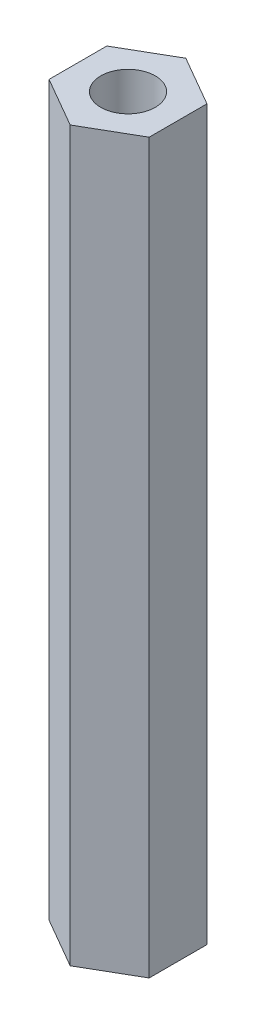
from build123d import *

# Parameters (mm, degrees)
SKETCH1_R           = 1.5
BOSS_EXTRUDE1_DEPTH = 40


with BuildPart() as part:
    # Sketch1 → Boss-Extrude1 (new body)
    with BuildSketch(Plane(origin=(0, 0, 0), x_dir=(1, 0, 0), z_dir=(0, 1, 0))):
        Polygon((2.75, 1.58771324), (0, 3.175426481), (-2.75, 1.58771324), (-2.75, -1.58771324), (0, -3.175426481), (2.75, -1.58771324), align=None)
        with Locations(Location((0, 0, 0), (0, 0, 270))):
            Circle(SKETCH1_R, mode=Mode.SUBTRACT)
    extrude(amount=BOSS_EXTRUDE1_DEPTH)


solid = part.part
